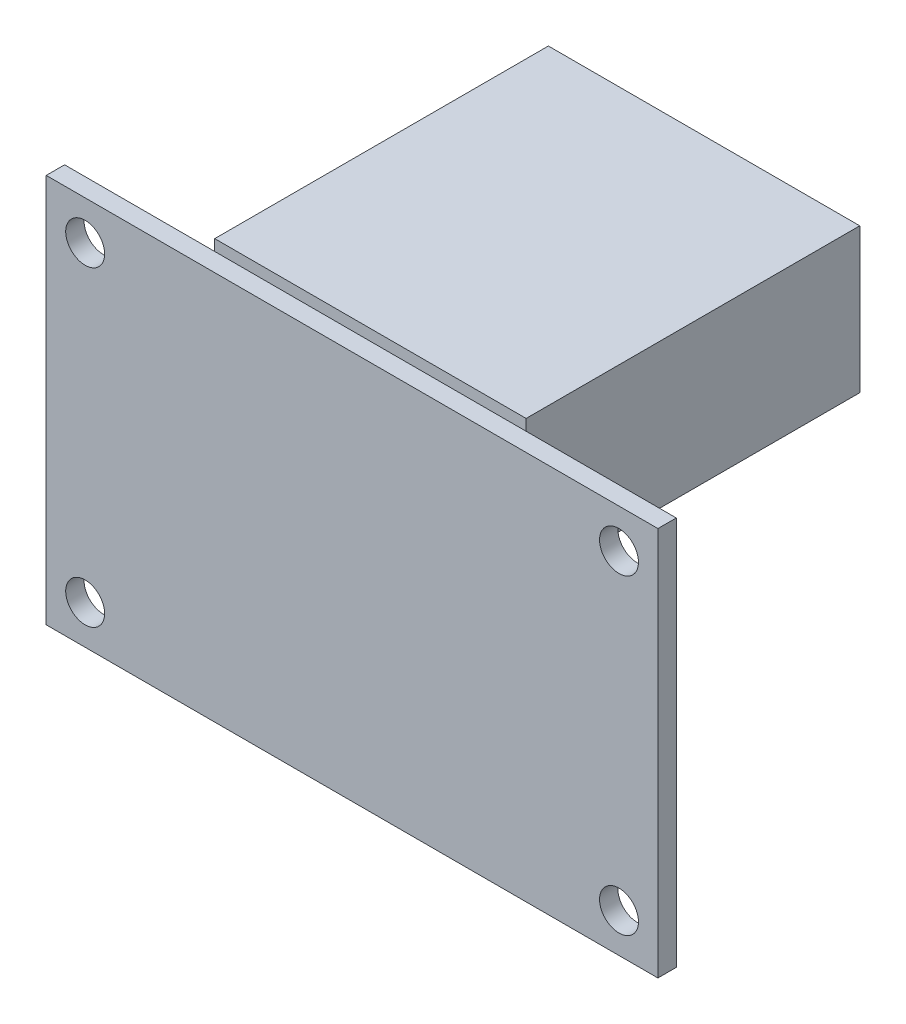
from build123d import *

# Parameters (mm, degrees)
ESQUISSE1_W        = 55
ESQUISSE1_H        = 35
ESQUISSE1_R        = 1.75
BOSS_EXTRU_1_DEPTH = 1.65
ESQUISSE2_W        = 28
ESQUISSE2_H        = 13
BOSS_EXTRU_2_DEPTH = 30


with BuildPart() as part:
    # Esquisse1 → Boss.-Extru.1 (new body)
    with BuildSketch(Plane.XY):
        with Locations((-0.015232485, 13.940586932)):
            Rectangle(ESQUISSE1_W, ESQUISSE1_H)
        with Locations((-24.015232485, 27.940586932)):
            Circle(ESQUISSE1_R, mode=Mode.SUBTRACT)
        with Locations((-24.015232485, -0.059413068)):
            Circle(ESQUISSE1_R, mode=Mode.SUBTRACT)
        with Locations((23.984767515, 27.940586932)):
            Circle(ESQUISSE1_R, mode=Mode.SUBTRACT)
        with Locations((23.984767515, -0.059413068)):
            Circle(ESQUISSE1_R, mode=Mode.SUBTRACT)
    extrude(amount=BOSS_EXTRU_1_DEPTH)

    # Esquisse2 → Boss.-Extru.2 (add)
    with BuildSketch(Plane(origin=(0, 0, 0), x_dir=(-1, 0, 0), z_dir=(0, 0, -1))):
        with Locations((0.015232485, 25.940586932)):
            Rectangle(ESQUISSE2_W, ESQUISSE2_H)
    extrude(amount=BOSS_EXTRU_2_DEPTH)


solid = part.part
